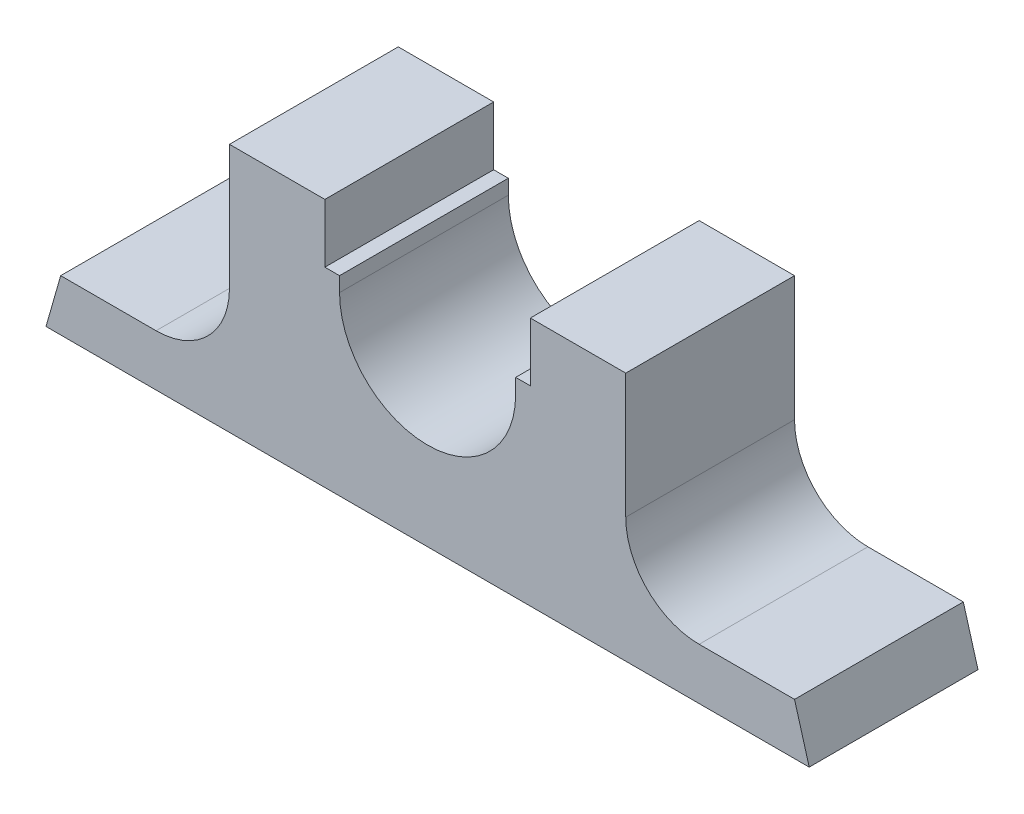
ISO-10303-21;
HEADER;
FILE_DESCRIPTION(('STEP AP214'),'2;1');
FILE_NAME('part.step','',(''),(''),'','','');
FILE_SCHEMA(('AUTOMOTIVE_DESIGN { 1 0 10303 214 1 1 1 1 }'));
ENDSEC;
DATA;
#1=APPLICATION_CONTEXT('core data for automotive mechanical design processes');
#2=APPLICATION_PROTOCOL_DEFINITION('international standard','automotive_design',2000,#1);
#3=PRODUCT_CONTEXT('',#1,'mechanical');
#4=PRODUCT('Part','Part','',(#3));
#5=PRODUCT_RELATED_PRODUCT_CATEGORY('part','',(#4));
#6=PRODUCT_DEFINITION_FORMATION('','',#4);
#7=PRODUCT_DEFINITION_CONTEXT('part definition',#1,'design');
#8=PRODUCT_DEFINITION('design','',#6,#7);
#9=PRODUCT_DEFINITION_SHAPE('','',#8);
#10=(LENGTH_UNIT() NAMED_UNIT(*) SI_UNIT(.MILLI.,.METRE.));
#11=(NAMED_UNIT(*) PLANE_ANGLE_UNIT() SI_UNIT($,.RADIAN.));
#12=(NAMED_UNIT(*) SI_UNIT($,.STERADIAN.) SOLID_ANGLE_UNIT());
#13=UNCERTAINTY_MEASURE_WITH_UNIT(LENGTH_MEASURE(1.E-05),#10,'distance_accuracy_value','');
#14=(GEOMETRIC_REPRESENTATION_CONTEXT(3) GLOBAL_UNCERTAINTY_ASSIGNED_CONTEXT((#13)) GLOBAL_UNIT_ASSIGNED_CONTEXT((#10,
#11,#12)) REPRESENTATION_CONTEXT('',''));
#15=CARTESIAN_POINT('',(0.,0.,0.));
#16=DIRECTION('',(0.,0.,1.));
#17=DIRECTION('',(1.,0.,0.));
#18=AXIS2_PLACEMENT_3D('',#15,#16,#17);
#19=CARTESIAN_POINT('',(-104.,0.,23.));
#20=DIRECTION('',(0.961523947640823,-0.27472112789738,0.));
#21=DIRECTION('',(0.27472112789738,0.961523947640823,0.));
#22=AXIS2_PLACEMENT_3D('',#19,#20,#21);
#23=PLANE('',#22);
#24=DIRECTION('',(-0.27472112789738,-0.961523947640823,0.));
#25=VECTOR('',#24,1.);
#26=CARTESIAN_POINT('',(-104.,0.,-23.));
#27=LINE('',#26,#25);
#28=CARTESIAN_POINT('',(-100.,14.,-23.));
#29=VERTEX_POINT('',#28);
#30=CARTESIAN_POINT('',(-104.,0.,-23.));
#31=VERTEX_POINT('',#30);
#32=EDGE_CURVE('E154',#29,#31,#27,.T.);
#33=ORIENTED_EDGE('',*,*,#32,.T.);
#34=DIRECTION('',(0.,0.,-1.));
#35=VECTOR('',#34,1.);
#36=CARTESIAN_POINT('',(-104.,0.,23.));
#37=LINE('',#36,#35);
#38=CARTESIAN_POINT('',(-104.,0.,23.));
#39=VERTEX_POINT('',#38);
#40=EDGE_CURVE('E161',#39,#31,#37,.T.);
#41=ORIENTED_EDGE('',*,*,#40,.F.);
#42=DIRECTION('',(-0.27472112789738,-0.961523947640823,0.));
#43=VECTOR('',#42,1.);
#44=CARTESIAN_POINT('',(-104.,0.,23.));
#45=LINE('',#44,#43);
#46=CARTESIAN_POINT('',(-100.,14.,23.));
#47=VERTEX_POINT('',#46);
#48=EDGE_CURVE('E204',#47,#39,#45,.T.);
#49=ORIENTED_EDGE('',*,*,#48,.F.);
#50=DIRECTION('',(0.,0.,-1.));
#51=VECTOR('',#50,1.);
#52=CARTESIAN_POINT('',(-100.,14.,23.));
#53=LINE('',#52,#51);
#54=EDGE_CURVE('E172',#47,#29,#53,.T.);
#55=ORIENTED_EDGE('',*,*,#54,.T.);
#56=EDGE_LOOP('',(#33,#41,#49,#55));
#57=FACE_BOUND('',#56,.T.);
#58=ADVANCED_FACE('F26',(#57),#23,.F.);
#59=CARTESIAN_POINT('',(-104.,0.,23.));
#60=DIRECTION('',(0.,1.,0.));
#61=DIRECTION('',(0.,0.,1.));
#62=AXIS2_PLACEMENT_3D('',#59,#60,#61);
#63=PLANE('',#62);
#64=DIRECTION('',(1.,0.,0.));
#65=VECTOR('',#64,1.);
#66=CARTESIAN_POINT('',(-104.,0.,-23.));
#67=LINE('',#66,#65);
#68=CARTESIAN_POINT('',(104.,0.,-23.));
#69=VERTEX_POINT('',#68);
#70=EDGE_CURVE('E149',#31,#69,#67,.T.);
#71=ORIENTED_EDGE('',*,*,#70,.T.);
#72=DIRECTION('',(0.,0.,-1.));
#73=VECTOR('',#72,1.);
#74=CARTESIAN_POINT('',(104.,0.,23.));
#75=LINE('',#74,#73);
#76=CARTESIAN_POINT('',(104.,0.,23.));
#77=VERTEX_POINT('',#76);
#78=EDGE_CURVE('E168',#77,#69,#75,.T.);
#79=ORIENTED_EDGE('',*,*,#78,.F.);
#80=DIRECTION('',(1.,0.,0.));
#81=VECTOR('',#80,1.);
#82=CARTESIAN_POINT('',(-104.,0.,23.));
#83=LINE('',#82,#81);
#84=EDGE_CURVE('E163',#39,#77,#83,.T.);
#85=ORIENTED_EDGE('',*,*,#84,.F.);
#86=ORIENTED_EDGE('',*,*,#40,.T.);
#87=EDGE_LOOP('',(#71,#79,#85,#86));
#88=FACE_BOUND('',#87,.T.);
#89=ADVANCED_FACE('F162',(#88),#63,.F.);
#90=CARTESIAN_POINT('',(104.,0.,23.));
#91=DIRECTION('',(-0.961523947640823,-0.274721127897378,0.));
#92=DIRECTION('',(0.274721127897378,-0.961523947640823,0.));
#93=AXIS2_PLACEMENT_3D('',#90,#91,#92);
#94=PLANE('',#93);
#95=DIRECTION('',(-0.274721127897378,0.961523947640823,0.));
#96=VECTOR('',#95,1.);
#97=CARTESIAN_POINT('',(104.,0.,-23.));
#98=LINE('',#97,#96);
#99=CARTESIAN_POINT('',(100.,14.,-23.));
#100=VERTEX_POINT('',#99);
#101=EDGE_CURVE('E155',#69,#100,#98,.T.);
#102=ORIENTED_EDGE('',*,*,#101,.T.);
#103=DIRECTION('',(0.,0.,-1.));
#104=VECTOR('',#103,1.);
#105=CARTESIAN_POINT('',(100.,14.,23.));
#106=LINE('',#105,#104);
#107=CARTESIAN_POINT('',(100.,14.,23.));
#108=VERTEX_POINT('',#107);
#109=EDGE_CURVE('E267',#108,#100,#106,.T.);
#110=ORIENTED_EDGE('',*,*,#109,.F.);
#111=DIRECTION('',(-0.274721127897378,0.961523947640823,0.));
#112=VECTOR('',#111,1.);
#113=CARTESIAN_POINT('',(104.,0.,23.));
#114=LINE('',#113,#112);
#115=EDGE_CURVE('E207',#77,#108,#114,.T.);
#116=ORIENTED_EDGE('',*,*,#115,.F.);
#117=ORIENTED_EDGE('',*,*,#78,.T.);
#118=EDGE_LOOP('',(#102,#110,#116,#117));
#119=FACE_BOUND('',#118,.T.);
#120=ADVANCED_FACE('F352',(#119),#94,.F.);
#121=CARTESIAN_POINT('',(100.,14.,23.));
#122=DIRECTION('',(0.,-1.,0.));
#123=DIRECTION('',(1.,0.,0.));
#124=AXIS2_PLACEMENT_3D('',#121,#122,#123);
#125=PLANE('',#124);
#126=DIRECTION('',(-1.,0.,0.));
#127=VECTOR('',#126,1.);
#128=CARTESIAN_POINT('',(100.,14.,-23.));
#129=LINE('',#128,#127);
#130=CARTESIAN_POINT('',(74.,14.,-23.));
#131=VERTEX_POINT('',#130);
#132=EDGE_CURVE('E176',#100,#131,#129,.T.);
#133=ORIENTED_EDGE('',*,*,#132,.T.);
#134=DIRECTION('',(0.,0.,-1.));
#135=VECTOR('',#134,1.);
#136=CARTESIAN_POINT('',(74.,14.,23.));
#137=LINE('',#136,#135);
#138=CARTESIAN_POINT('',(74.,14.,23.));
#139=VERTEX_POINT('',#138);
#140=EDGE_CURVE('E40',#131,#139,#137,.F.);
#141=ORIENTED_EDGE('',*,*,#140,.T.);
#142=DIRECTION('',(-1.,0.,0.));
#143=VECTOR('',#142,1.);
#144=CARTESIAN_POINT('',(100.,14.,23.));
#145=LINE('',#144,#143);
#146=EDGE_CURVE('E209',#108,#139,#145,.T.);
#147=ORIENTED_EDGE('',*,*,#146,.F.);
#148=ORIENTED_EDGE('',*,*,#109,.T.);
#149=EDGE_LOOP('',(#133,#141,#147,#148));
#150=FACE_BOUND('',#149,.T.);
#151=ADVANCED_FACE('F350',(#150),#125,.F.);
#152=CARTESIAN_POINT('',(54.,14.,23.));
#153=DIRECTION('',(-1.,0.,0.));
#154=DIRECTION('',(0.,0.,1.));
#155=AXIS2_PLACEMENT_3D('',#152,#153,#154);
#156=PLANE('',#155);
#157=DIRECTION('',(0.,1.,0.));
#158=VECTOR('',#157,1.);
#159=CARTESIAN_POINT('',(54.,14.,23.));
#160=LINE('',#159,#158);
#161=CARTESIAN_POINT('',(54.,34.,23.));
#162=VERTEX_POINT('',#161);
#163=CARTESIAN_POINT('',(54.,68.,23.));
#164=VERTEX_POINT('',#163);
#165=EDGE_CURVE('E211',#162,#164,#160,.T.);
#166=ORIENTED_EDGE('',*,*,#165,.F.);
#167=DIRECTION('',(0.,0.,-1.));
#168=VECTOR('',#167,1.);
#169=CARTESIAN_POINT('',(54.,34.,-23.));
#170=LINE('',#169,#168);
#171=CARTESIAN_POINT('',(54.,34.,-23.));
#172=VERTEX_POINT('',#171);
#173=EDGE_CURVE('E275',#162,#172,#170,.T.);
#174=ORIENTED_EDGE('',*,*,#173,.T.);
#175=DIRECTION('',(0.,1.,0.));
#176=VECTOR('',#175,1.);
#177=CARTESIAN_POINT('',(54.,14.,-23.));
#178=LINE('',#177,#176);
#179=CARTESIAN_POINT('',(54.,68.,-23.));
#180=VERTEX_POINT('',#179);
#181=EDGE_CURVE('E178',#172,#180,#178,.T.);
#182=ORIENTED_EDGE('',*,*,#181,.T.);
#183=DIRECTION('',(0.,0.,-1.));
#184=VECTOR('',#183,1.);
#185=CARTESIAN_POINT('',(54.,68.,23.));
#186=LINE('',#185,#184);
#187=EDGE_CURVE('E264',#164,#180,#186,.T.);
#188=ORIENTED_EDGE('',*,*,#187,.F.);
#189=EDGE_LOOP('',(#166,#174,#182,#188));
#190=FACE_BOUND('',#189,.T.);
#191=ADVANCED_FACE('F343',(#190),#156,.F.);
#192=CARTESIAN_POINT('',(54.,68.,23.));
#193=DIRECTION('',(0.,-1.,0.));
#194=DIRECTION('',(0.,0.,-1.));
#195=AXIS2_PLACEMENT_3D('',#192,#193,#194);
#196=PLANE('',#195);
#197=DIRECTION('',(-1.,0.,0.));
#198=VECTOR('',#197,1.);
#199=CARTESIAN_POINT('',(54.,68.,-23.));
#200=LINE('',#199,#198);
#201=CARTESIAN_POINT('',(28.,68.,-23.));
#202=VERTEX_POINT('',#201);
#203=EDGE_CURVE('E180',#180,#202,#200,.T.);
#204=ORIENTED_EDGE('',*,*,#203,.T.);
#205=DIRECTION('',(0.,0.,-1.));
#206=VECTOR('',#205,1.);
#207=CARTESIAN_POINT('',(28.,68.,23.));
#208=LINE('',#207,#206);
#209=CARTESIAN_POINT('',(28.,68.,23.));
#210=VERTEX_POINT('',#209);
#211=EDGE_CURVE('E261',#210,#202,#208,.T.);
#212=ORIENTED_EDGE('',*,*,#211,.F.);
#213=DIRECTION('',(-1.,0.,0.));
#214=VECTOR('',#213,1.);
#215=CARTESIAN_POINT('',(54.,68.,23.));
#216=LINE('',#215,#214);
#217=EDGE_CURVE('E213',#164,#210,#216,.T.);
#218=ORIENTED_EDGE('',*,*,#217,.F.);
#219=ORIENTED_EDGE('',*,*,#187,.T.);
#220=EDGE_LOOP('',(#204,#212,#218,#219));
#221=FACE_BOUND('',#220,.T.);
#222=ADVANCED_FACE('F339',(#221),#196,.F.);
#223=CARTESIAN_POINT('',(28.,68.,23.));
#224=DIRECTION('',(1.,0.,0.));
#225=DIRECTION('',(0.,0.,-1.));
#226=AXIS2_PLACEMENT_3D('',#223,#224,#225);
#227=PLANE('',#226);
#228=DIRECTION('',(0.,-1.,0.));
#229=VECTOR('',#228,1.);
#230=CARTESIAN_POINT('',(28.,68.,-23.));
#231=LINE('',#230,#229);
#232=CARTESIAN_POINT('',(28.,52.,-23.));
#233=VERTEX_POINT('',#232);
#234=EDGE_CURVE('E182',#202,#233,#231,.T.);
#235=ORIENTED_EDGE('',*,*,#234,.T.);
#236=DIRECTION('',(0.,0.,-1.));
#237=VECTOR('',#236,1.);
#238=CARTESIAN_POINT('',(28.,52.,23.));
#239=LINE('',#238,#237);
#240=CARTESIAN_POINT('',(28.,52.,23.));
#241=VERTEX_POINT('',#240);
#242=EDGE_CURVE('E258',#241,#233,#239,.T.);
#243=ORIENTED_EDGE('',*,*,#242,.F.);
#244=DIRECTION('',(0.,-1.,0.));
#245=VECTOR('',#244,1.);
#246=CARTESIAN_POINT('',(28.,68.,23.));
#247=LINE('',#246,#245);
#248=EDGE_CURVE('E215',#210,#241,#247,.T.);
#249=ORIENTED_EDGE('',*,*,#248,.F.);
#250=ORIENTED_EDGE('',*,*,#211,.T.);
#251=EDGE_LOOP('',(#235,#243,#249,#250));
#252=FACE_BOUND('',#251,.T.);
#253=ADVANCED_FACE('F335',(#252),#227,.F.);
#254=CARTESIAN_POINT('',(28.,52.,23.));
#255=DIRECTION('',(0.,-1.,0.));
#256=DIRECTION('',(1.,0.,0.));
#257=AXIS2_PLACEMENT_3D('',#254,#255,#256);
#258=PLANE('',#257);
#259=DIRECTION('',(-1.,0.,0.));
#260=VECTOR('',#259,1.);
#261=CARTESIAN_POINT('',(28.,52.,-23.));
#262=LINE('',#261,#260);
#263=CARTESIAN_POINT('',(24.,52.,-23.));
#264=VERTEX_POINT('',#263);
#265=EDGE_CURVE('E184',#233,#264,#262,.T.);
#266=ORIENTED_EDGE('',*,*,#265,.T.);
#267=DIRECTION('',(0.,0.,-1.));
#268=VECTOR('',#267,1.);
#269=CARTESIAN_POINT('',(24.,52.,23.));
#270=LINE('',#269,#268);
#271=CARTESIAN_POINT('',(24.,52.,23.));
#272=VERTEX_POINT('',#271);
#273=EDGE_CURVE('E255',#272,#264,#270,.T.);
#274=ORIENTED_EDGE('',*,*,#273,.F.);
#275=DIRECTION('',(-1.,0.,0.));
#276=VECTOR('',#275,1.);
#277=CARTESIAN_POINT('',(28.,52.,23.));
#278=LINE('',#277,#276);
#279=EDGE_CURVE('E217',#241,#272,#278,.T.);
#280=ORIENTED_EDGE('',*,*,#279,.F.);
#281=ORIENTED_EDGE('',*,*,#242,.T.);
#282=EDGE_LOOP('',(#266,#274,#280,#281));
#283=FACE_BOUND('',#282,.T.);
#284=ADVANCED_FACE('F331',(#283),#258,.F.);
#285=CARTESIAN_POINT('',(24.,52.,23.));
#286=DIRECTION('',(1.,0.,0.));
#287=DIRECTION('',(0.,1.,0.));
#288=AXIS2_PLACEMENT_3D('',#285,#286,#287);
#289=PLANE('',#288);
#290=DIRECTION('',(0.,-1.,0.));
#291=VECTOR('',#290,1.);
#292=CARTESIAN_POINT('',(24.,52.,-23.));
#293=LINE('',#292,#291);
#294=CARTESIAN_POINT('',(24.,48.,-23.));
#295=VERTEX_POINT('',#294);
#296=EDGE_CURVE('E186',#264,#295,#293,.T.);
#297=ORIENTED_EDGE('',*,*,#296,.T.);
#298=DIRECTION('',(0.,0.,-1.));
#299=VECTOR('',#298,1.);
#300=CARTESIAN_POINT('',(24.,48.,23.));
#301=LINE('',#300,#299);
#302=CARTESIAN_POINT('',(24.,48.,23.));
#303=VERTEX_POINT('',#302);
#304=EDGE_CURVE('E252',#303,#295,#301,.T.);
#305=ORIENTED_EDGE('',*,*,#304,.F.);
#306=DIRECTION('',(0.,-1.,0.));
#307=VECTOR('',#306,1.);
#308=CARTESIAN_POINT('',(24.,52.,23.));
#309=LINE('',#308,#307);
#310=EDGE_CURVE('E219',#272,#303,#309,.T.);
#311=ORIENTED_EDGE('',*,*,#310,.F.);
#312=ORIENTED_EDGE('',*,*,#273,.T.);
#313=EDGE_LOOP('',(#297,#305,#311,#312));
#314=FACE_BOUND('',#313,.T.);
#315=ADVANCED_FACE('F322',(#314),#289,.F.);
#316=CARTESIAN_POINT('',(0.,48.,23.));
#317=DIRECTION('',(0.,0.,-1.));
#318=DIRECTION('',(-1.,0.,0.));
#319=AXIS2_PLACEMENT_3D('',#316,#317,#318);
#320=CYLINDRICAL_SURFACE('',#319,24.);
#321=CARTESIAN_POINT('',(0.,48.,-23.));
#322=DIRECTION('',(0.,0.,-1.));
#323=DIRECTION('',(1.,0.,0.));
#324=AXIS2_PLACEMENT_3D('',#321,#322,#323);
#325=CIRCLE('',#324,24.);
#326=CARTESIAN_POINT('',(-24.,48.,-23.));
#327=VERTEX_POINT('',#326);
#328=EDGE_CURVE('E189',#295,#327,#325,.T.);
#329=ORIENTED_EDGE('',*,*,#328,.T.);
#330=DIRECTION('',(0.,0.,-1.));
#331=VECTOR('',#330,1.);
#332=CARTESIAN_POINT('',(-24.,48.,23.));
#333=LINE('',#332,#331);
#334=CARTESIAN_POINT('',(-24.,48.,23.));
#335=VERTEX_POINT('',#334);
#336=EDGE_CURVE('E249',#335,#327,#333,.T.);
#337=ORIENTED_EDGE('',*,*,#336,.F.);
#338=CARTESIAN_POINT('',(0.,48.,23.));
#339=DIRECTION('',(0.,0.,-1.));
#340=DIRECTION('',(-1.,0.,0.));
#341=AXIS2_PLACEMENT_3D('',#338,#339,#340);
#342=CIRCLE('',#341,24.);
#343=EDGE_CURVE('E221',#303,#335,#342,.T.);
#344=ORIENTED_EDGE('',*,*,#343,.F.);
#345=ORIENTED_EDGE('',*,*,#304,.T.);
#346=EDGE_LOOP('',(#329,#337,#344,#345));
#347=FACE_BOUND('',#346,.T.);
#348=ADVANCED_FACE('F326',(#347),#320,.F.);
#349=CARTESIAN_POINT('',(-24.,52.,23.));
#350=DIRECTION('',(-1.,0.,0.));
#351=DIRECTION('',(0.,-1.,0.));
#352=AXIS2_PLACEMENT_3D('',#349,#350,#351);
#353=PLANE('',#352);
#354=DIRECTION('',(0.,1.,0.));
#355=VECTOR('',#354,1.);
#356=CARTESIAN_POINT('',(-24.,52.,-23.));
#357=LINE('',#356,#355);
#358=CARTESIAN_POINT('',(-24.,52.,-23.));
#359=VERTEX_POINT('',#358);
#360=EDGE_CURVE('E191',#327,#359,#357,.T.);
#361=ORIENTED_EDGE('',*,*,#360,.T.);
#362=DIRECTION('',(0.,0.,-1.));
#363=VECTOR('',#362,1.);
#364=CARTESIAN_POINT('',(-24.,52.,23.));
#365=LINE('',#364,#363);
#366=CARTESIAN_POINT('',(-24.,52.,23.));
#367=VERTEX_POINT('',#366);
#368=EDGE_CURVE('E246',#367,#359,#365,.T.);
#369=ORIENTED_EDGE('',*,*,#368,.F.);
#370=DIRECTION('',(0.,1.,0.));
#371=VECTOR('',#370,1.);
#372=CARTESIAN_POINT('',(-24.,52.,23.));
#373=LINE('',#372,#371);
#374=EDGE_CURVE('E223',#335,#367,#373,.T.);
#375=ORIENTED_EDGE('',*,*,#374,.F.);
#376=ORIENTED_EDGE('',*,*,#336,.T.);
#377=EDGE_LOOP('',(#361,#369,#375,#376));
#378=FACE_BOUND('',#377,.T.);
#379=ADVANCED_FACE('F315',(#378),#353,.F.);
#380=CARTESIAN_POINT('',(-28.,52.,23.));
#381=DIRECTION('',(0.,-1.,0.));
#382=DIRECTION('',(1.,0.,0.));
#383=AXIS2_PLACEMENT_3D('',#380,#381,#382);
#384=PLANE('',#383);
#385=DIRECTION('',(-1.,0.,0.));
#386=VECTOR('',#385,1.);
#387=CARTESIAN_POINT('',(-28.,52.,-23.));
#388=LINE('',#387,#386);
#389=CARTESIAN_POINT('',(-28.,52.,-23.));
#390=VERTEX_POINT('',#389);
#391=EDGE_CURVE('E193',#359,#390,#388,.T.);
#392=ORIENTED_EDGE('',*,*,#391,.T.);
#393=DIRECTION('',(0.,0.,-1.));
#394=VECTOR('',#393,1.);
#395=CARTESIAN_POINT('',(-28.,52.,23.));
#396=LINE('',#395,#394);
#397=CARTESIAN_POINT('',(-28.,52.,23.));
#398=VERTEX_POINT('',#397);
#399=EDGE_CURVE('E243',#398,#390,#396,.T.);
#400=ORIENTED_EDGE('',*,*,#399,.F.);
#401=DIRECTION('',(-1.,0.,0.));
#402=VECTOR('',#401,1.);
#403=CARTESIAN_POINT('',(-28.,52.,23.));
#404=LINE('',#403,#402);
#405=EDGE_CURVE('E225',#367,#398,#404,.T.);
#406=ORIENTED_EDGE('',*,*,#405,.F.);
#407=ORIENTED_EDGE('',*,*,#368,.T.);
#408=EDGE_LOOP('',(#392,#400,#406,#407));
#409=FACE_BOUND('',#408,.T.);
#410=ADVANCED_FACE('F311',(#409),#384,.F.);
#411=CARTESIAN_POINT('',(-28.,68.,23.));
#412=DIRECTION('',(-1.,0.,0.));
#413=DIRECTION('',(0.,0.,1.));
#414=AXIS2_PLACEMENT_3D('',#411,#412,#413);
#415=PLANE('',#414);
#416=DIRECTION('',(0.,1.,0.));
#417=VECTOR('',#416,1.);
#418=CARTESIAN_POINT('',(-28.,68.,-23.));
#419=LINE('',#418,#417);
#420=CARTESIAN_POINT('',(-28.,68.,-23.));
#421=VERTEX_POINT('',#420);
#422=EDGE_CURVE('E195',#390,#421,#419,.T.);
#423=ORIENTED_EDGE('',*,*,#422,.T.);
#424=DIRECTION('',(0.,0.,-1.));
#425=VECTOR('',#424,1.);
#426=CARTESIAN_POINT('',(-28.,68.,23.));
#427=LINE('',#426,#425);
#428=CARTESIAN_POINT('',(-28.,68.,23.));
#429=VERTEX_POINT('',#428);
#430=EDGE_CURVE('E240',#429,#421,#427,.T.);
#431=ORIENTED_EDGE('',*,*,#430,.F.);
#432=DIRECTION('',(0.,1.,0.));
#433=VECTOR('',#432,1.);
#434=CARTESIAN_POINT('',(-28.,68.,23.));
#435=LINE('',#434,#433);
#436=EDGE_CURVE('E227',#398,#429,#435,.T.);
#437=ORIENTED_EDGE('',*,*,#436,.F.);
#438=ORIENTED_EDGE('',*,*,#399,.T.);
#439=EDGE_LOOP('',(#423,#431,#437,#438));
#440=FACE_BOUND('',#439,.T.);
#441=ADVANCED_FACE('F306',(#440),#415,.F.);
#442=CARTESIAN_POINT('',(-54.,68.,23.));
#443=DIRECTION('',(0.,-1.,0.));
#444=DIRECTION('',(1.,0.,0.));
#445=AXIS2_PLACEMENT_3D('',#442,#443,#444);
#446=PLANE('',#445);
#447=DIRECTION('',(-1.,0.,0.));
#448=VECTOR('',#447,1.);
#449=CARTESIAN_POINT('',(-54.,68.,-23.));
#450=LINE('',#449,#448);
#451=CARTESIAN_POINT('',(-54.,68.,-23.));
#452=VERTEX_POINT('',#451);
#453=EDGE_CURVE('E197',#421,#452,#450,.T.);
#454=ORIENTED_EDGE('',*,*,#453,.T.);
#455=DIRECTION('',(0.,0.,-1.));
#456=VECTOR('',#455,1.);
#457=CARTESIAN_POINT('',(-54.,68.,23.));
#458=LINE('',#457,#456);
#459=CARTESIAN_POINT('',(-54.,68.,23.));
#460=VERTEX_POINT('',#459);
#461=EDGE_CURVE('E237',#460,#452,#458,.T.);
#462=ORIENTED_EDGE('',*,*,#461,.F.);
#463=DIRECTION('',(-1.,0.,0.));
#464=VECTOR('',#463,1.);
#465=CARTESIAN_POINT('',(-54.,68.,23.));
#466=LINE('',#465,#464);
#467=EDGE_CURVE('E229',#429,#460,#466,.T.);
#468=ORIENTED_EDGE('',*,*,#467,.F.);
#469=ORIENTED_EDGE('',*,*,#430,.T.);
#470=EDGE_LOOP('',(#454,#462,#468,#469));
#471=FACE_BOUND('',#470,.T.);
#472=ADVANCED_FACE('F300',(#471),#446,.F.);
#473=CARTESIAN_POINT('',(-54.,14.,23.));
#474=DIRECTION('',(1.,0.,0.));
#475=DIRECTION('',(0.,1.,0.));
#476=AXIS2_PLACEMENT_3D('',#473,#474,#475);
#477=PLANE('',#476);
#478=DIRECTION('',(0.,-1.,0.));
#479=VECTOR('',#478,1.);
#480=CARTESIAN_POINT('',(-54.,14.,-23.));
#481=LINE('',#480,#479);
#482=CARTESIAN_POINT('',(-54.,34.,-23.));
#483=VERTEX_POINT('',#482);
#484=EDGE_CURVE('E199',#452,#483,#481,.T.);
#485=ORIENTED_EDGE('',*,*,#484,.T.);
#486=DIRECTION('',(0.,0.,-1.));
#487=VECTOR('',#486,1.);
#488=CARTESIAN_POINT('',(-54.,34.,23.));
#489=LINE('',#488,#487);
#490=CARTESIAN_POINT('',(-54.,34.,23.));
#491=VERTEX_POINT('',#490);
#492=EDGE_CURVE('E273',#483,#491,#489,.F.);
#493=ORIENTED_EDGE('',*,*,#492,.T.);
#494=DIRECTION('',(0.,-1.,0.));
#495=VECTOR('',#494,1.);
#496=CARTESIAN_POINT('',(-54.,14.,23.));
#497=LINE('',#496,#495);
#498=EDGE_CURVE('E231',#460,#491,#497,.T.);
#499=ORIENTED_EDGE('',*,*,#498,.F.);
#500=ORIENTED_EDGE('',*,*,#461,.T.);
#501=EDGE_LOOP('',(#485,#493,#499,#500));
#502=FACE_BOUND('',#501,.T.);
#503=ADVANCED_FACE('F296',(#502),#477,.F.);
#504=CARTESIAN_POINT('',(-100.,14.,23.));
#505=DIRECTION('',(0.,-1.,0.));
#506=DIRECTION('',(1.,0.,0.));
#507=AXIS2_PLACEMENT_3D('',#504,#505,#506);
#508=PLANE('',#507);
#509=DIRECTION('',(-1.,0.,0.));
#510=VECTOR('',#509,1.);
#511=CARTESIAN_POINT('',(-100.,14.,23.));
#512=LINE('',#511,#510);
#513=CARTESIAN_POINT('',(-74.,14.,23.));
#514=VERTEX_POINT('',#513);
#515=EDGE_CURVE('E234',#514,#47,#512,.T.);
#516=ORIENTED_EDGE('',*,*,#515,.F.);
#517=DIRECTION('',(0.,0.,-1.));
#518=VECTOR('',#517,1.);
#519=CARTESIAN_POINT('',(-74.,14.,-23.));
#520=LINE('',#519,#518);
#521=CARTESIAN_POINT('',(-74.,14.,-23.));
#522=VERTEX_POINT('',#521);
#523=EDGE_CURVE('E167',#514,#522,#520,.T.);
#524=ORIENTED_EDGE('',*,*,#523,.T.);
#525=DIRECTION('',(-1.,0.,0.));
#526=VECTOR('',#525,1.);
#527=CARTESIAN_POINT('',(-100.,14.,-23.));
#528=LINE('',#527,#526);
#529=EDGE_CURVE('E202',#522,#29,#528,.T.);
#530=ORIENTED_EDGE('',*,*,#529,.T.);
#531=ORIENTED_EDGE('',*,*,#54,.F.);
#532=EDGE_LOOP('',(#516,#524,#530,#531));
#533=FACE_BOUND('',#532,.T.);
#534=ADVANCED_FACE('F291',(#533),#508,.F.);
#535=CARTESIAN_POINT('',(0.,48.,23.));
#536=DIRECTION('',(0.,0.,1.));
#537=DIRECTION('',(1.,0.,0.));
#538=AXIS2_PLACEMENT_3D('',#535,#536,#537);
#539=PLANE('',#538);
#540=ORIENTED_EDGE('',*,*,#48,.T.);
#541=ORIENTED_EDGE('',*,*,#84,.T.);
#542=ORIENTED_EDGE('',*,*,#115,.T.);
#543=ORIENTED_EDGE('',*,*,#146,.T.);
#544=CARTESIAN_POINT('',(74.,34.,23.));
#545=DIRECTION('',(0.,0.,1.));
#546=DIRECTION('',(1.,0.,0.));
#547=AXIS2_PLACEMENT_3D('',#544,#545,#546);
#548=CIRCLE('',#547,20.);
#549=EDGE_CURVE('E11',#139,#162,#548,.F.);
#550=ORIENTED_EDGE('',*,*,#549,.T.);
#551=ORIENTED_EDGE('',*,*,#165,.T.);
#552=ORIENTED_EDGE('',*,*,#217,.T.);
#553=ORIENTED_EDGE('',*,*,#248,.T.);
#554=ORIENTED_EDGE('',*,*,#279,.T.);
#555=ORIENTED_EDGE('',*,*,#310,.T.);
#556=ORIENTED_EDGE('',*,*,#343,.T.);
#557=ORIENTED_EDGE('',*,*,#374,.T.);
#558=ORIENTED_EDGE('',*,*,#405,.T.);
#559=ORIENTED_EDGE('',*,*,#436,.T.);
#560=ORIENTED_EDGE('',*,*,#467,.T.);
#561=ORIENTED_EDGE('',*,*,#498,.T.);
#562=CARTESIAN_POINT('',(-74.,34.,23.));
#563=DIRECTION('',(0.,0.,1.));
#564=DIRECTION('',(1.,0.,0.));
#565=AXIS2_PLACEMENT_3D('',#562,#563,#564);
#566=CIRCLE('',#565,20.);
#567=EDGE_CURVE('E281',#491,#514,#566,.F.);
#568=ORIENTED_EDGE('',*,*,#567,.T.);
#569=ORIENTED_EDGE('',*,*,#515,.T.);
#570=EDGE_LOOP('',(#540,#541,#542,#543,#550,#551,#552,#553,#554,#555,#556,#557,#558,#559,#560,
#561,#568,#569));
#571=FACE_BOUND('',#570,.T.);
#572=ADVANCED_FACE('F285',(#571),#539,.T.);
#573=CARTESIAN_POINT('',(0.,48.,-23.));
#574=DIRECTION('',(0.,0.,1.));
#575=DIRECTION('',(1.,0.,0.));
#576=AXIS2_PLACEMENT_3D('',#573,#574,#575);
#577=PLANE('',#576);
#578=ORIENTED_EDGE('',*,*,#32,.F.);
#579=ORIENTED_EDGE('',*,*,#529,.F.);
#580=CARTESIAN_POINT('',(-74.,34.,-23.));
#581=DIRECTION('',(0.,0.,1.));
#582=DIRECTION('',(1.,0.,0.));
#583=AXIS2_PLACEMENT_3D('',#580,#581,#582);
#584=CIRCLE('',#583,20.);
#585=EDGE_CURVE('E279',#522,#483,#584,.T.);
#586=ORIENTED_EDGE('',*,*,#585,.T.);
#587=ORIENTED_EDGE('',*,*,#484,.F.);
#588=ORIENTED_EDGE('',*,*,#453,.F.);
#589=ORIENTED_EDGE('',*,*,#422,.F.);
#590=ORIENTED_EDGE('',*,*,#391,.F.);
#591=ORIENTED_EDGE('',*,*,#360,.F.);
#592=ORIENTED_EDGE('',*,*,#328,.F.);
#593=ORIENTED_EDGE('',*,*,#296,.F.);
#594=ORIENTED_EDGE('',*,*,#265,.F.);
#595=ORIENTED_EDGE('',*,*,#234,.F.);
#596=ORIENTED_EDGE('',*,*,#203,.F.);
#597=ORIENTED_EDGE('',*,*,#181,.F.);
#598=CARTESIAN_POINT('',(74.,34.,-23.));
#599=DIRECTION('',(0.,0.,1.));
#600=DIRECTION('',(1.,0.,0.));
#601=AXIS2_PLACEMENT_3D('',#598,#599,#600);
#602=CIRCLE('',#601,20.);
#603=EDGE_CURVE('E33',#172,#131,#602,.T.);
#604=ORIENTED_EDGE('',*,*,#603,.T.);
#605=ORIENTED_EDGE('',*,*,#132,.F.);
#606=ORIENTED_EDGE('',*,*,#101,.F.);
#607=ORIENTED_EDGE('',*,*,#70,.F.);
#608=EDGE_LOOP('',(#578,#579,#586,#587,#588,#589,#590,#591,#592,#593,#594,#595,#596,#597,#604,
#605,#606,#607));
#609=FACE_BOUND('',#608,.T.);
#610=ADVANCED_FACE('F151',(#609),#577,.F.);
#611=CARTESIAN_POINT('',(-74.,34.,23.));
#612=DIRECTION('',(0.,0.,1.));
#613=DIRECTION('',(1.,0.,0.));
#614=AXIS2_PLACEMENT_3D('',#611,#612,#613);
#615=CYLINDRICAL_SURFACE('',#614,20.);
#616=ORIENTED_EDGE('',*,*,#567,.F.);
#617=ORIENTED_EDGE('',*,*,#492,.F.);
#618=ORIENTED_EDGE('',*,*,#585,.F.);
#619=ORIENTED_EDGE('',*,*,#523,.F.);
#620=EDGE_LOOP('',(#616,#617,#618,#619));
#621=FACE_BOUND('',#620,.T.);
#622=ADVANCED_FACE('F292',(#621),#615,.F.);
#623=CARTESIAN_POINT('',(74.,34.,23.));
#624=DIRECTION('',(0.,0.,1.));
#625=DIRECTION('',(1.,0.,0.));
#626=AXIS2_PLACEMENT_3D('',#623,#624,#625);
#627=CYLINDRICAL_SURFACE('',#626,20.);
#628=ORIENTED_EDGE('',*,*,#549,.F.);
#629=ORIENTED_EDGE('',*,*,#140,.F.);
#630=ORIENTED_EDGE('',*,*,#603,.F.);
#631=ORIENTED_EDGE('',*,*,#173,.F.);
#632=EDGE_LOOP('',(#628,#629,#630,#631));
#633=FACE_BOUND('',#632,.T.);
#634=ADVANCED_FACE('F347',(#633),#627,.F.);
#635=CLOSED_SHELL('',(#58,#89,#120,#151,#191,#222,#253,#284,#315,#348,#379,#410,#441,#472,#503,
#534,#572,#610,#622,#634));
#636=MANIFOLD_SOLID_BREP('B2',#635);
#637=ADVANCED_BREP_SHAPE_REPRESENTATION('',(#18,#636),#14);
#638=SHAPE_DEFINITION_REPRESENTATION(#9,#637);
ENDSEC;
END-ISO-10303-21;
